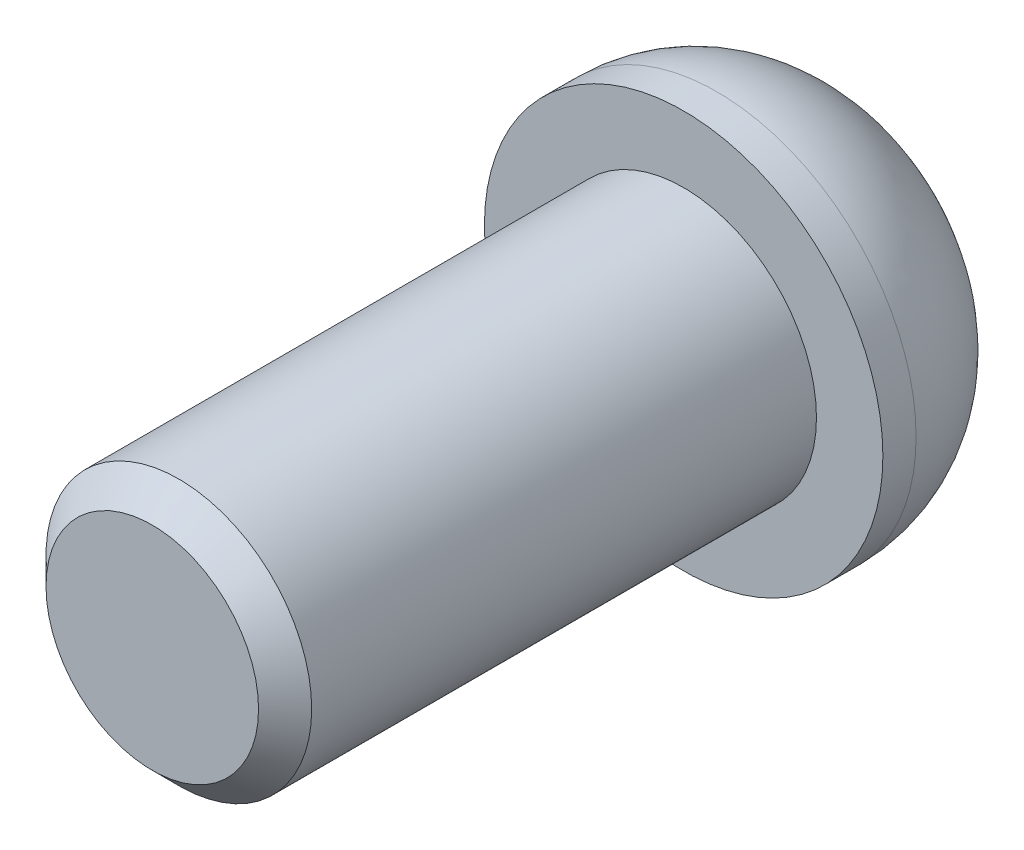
from build123d import *

# Parameters (mm, degrees)
ENLEV_MAT_EXTRU1_DEPTH = 4
ESQUISSE3_W            = 4
ESQUISSE3_H            = 16
CHANFREIN1_SIZE        = 0.8


with BuildPart() as part:
    # Esquisse1 → Base-R_volution (revolve)
    with BuildSketch(Plane(origin=(0, 0, 0), x_dir=(1, 0, 0), z_dir=(0, 1, 0)), mode=Mode.PRIVATE) as base_r_volution_sk:
        with BuildLine():
            Line((0, 0), (6, 0))
            Line((6, 0), (6, 1))
            ThreePointArc((6, 1), (4.681980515, 4.181980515), (1.5, 5.5))
            Line((1.5, 5.5), (0, 5.5))
            Line((0, 5.5), (0, 0))
        make_face()
    revolve(base_r_volution_sk.sketch.rotate(Axis((0, 0, 0), (0, 0, -1)), 180), axis=Axis((0, 0, 0), (0, 0, -1)))

    # Esquisse2 → enlev-mat-Extru1 (cut)
    with BuildSketch(Plane.XY.offset(-5.5)):
        Polygon((3, -1.732050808), (3, 1.732050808), (0, 3.464101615), (-3, 1.732050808), (-3, -1.732050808), (0, -3.464101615), align=None)
    extrude(amount=ENLEV_MAT_EXTRU1_DEPTH, mode=Mode.SUBTRACT)

    # Esquisse3 → Boss.-R_vol.1 (revolve)
    with BuildSketch(Plane(origin=(0, 0, 0), x_dir=(1, 0, 0), z_dir=(0, 1, 0))):
        with Locations((2, -8)):
            Rectangle(ESQUISSE3_W, ESQUISSE3_H)
    revolve(axis=Axis((0, 0, 0), (0, 0, 1)))

    # Chanfrein1
    chanfrein1_edges = [part.edges().sort_by_distance(p)[0] for p in [
        (-4, 0, 16),
    ]]
    chamfer(chanfrein1_edges, length=CHANFREIN1_SIZE)


solid = part.part
